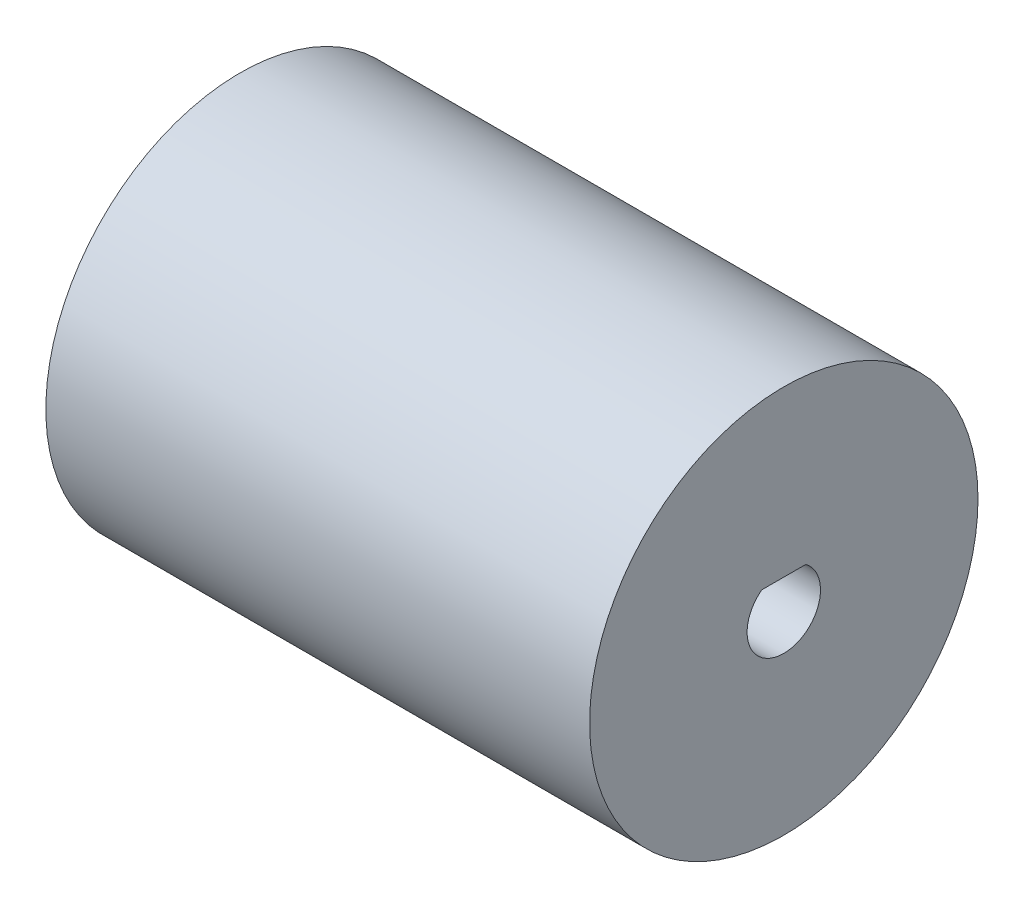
from build123d import *

# Parameters (mm, degrees)
SKETCH1_R      = 7.9375
EXTRUDE1_DEPTH = 22.225
EXTRUDE2_DEPTH = 11.1125
EXTRUDE3_DEPTH = 11.1125


with BuildPart() as part:
    # Sketch1 → Extrude1 (new body)
    with BuildSketch(Plane(origin=(0, 0, 0), x_dir=(0, 0, -1), z_dir=(1, 0, 0))):
        Circle(SKETCH1_R)
    extrude(amount=EXTRUDE1_DEPTH)

    # Sketch3 → Extrude2 (cut)
    with BuildSketch(Plane(origin=(22.225, 0, 0), x_dir=(0, 0, -1), z_dir=(1, 0, 0))):
        with BuildLine():
            Line((-0.9, 1.2), (0.9, 1.2))
            ThreePointArc((0.9, 1.2), (0, -1.5), (-0.9, 1.2))
        make_face()
    extrude(amount=-EXTRUDE2_DEPTH, mode=Mode.SUBTRACT)

    # Sketch6 → Extrude3 (cut)
    with BuildSketch(Plane.ZY):
        with BuildLine():
            Line((-1.905, 2.54), (1.905, 2.54))
            ThreePointArc((1.905, 2.54), (0, -3.175), (-1.905, 2.54))
        make_face()
    extrude(amount=-EXTRUDE3_DEPTH, mode=Mode.SUBTRACT)


solid = part.part
